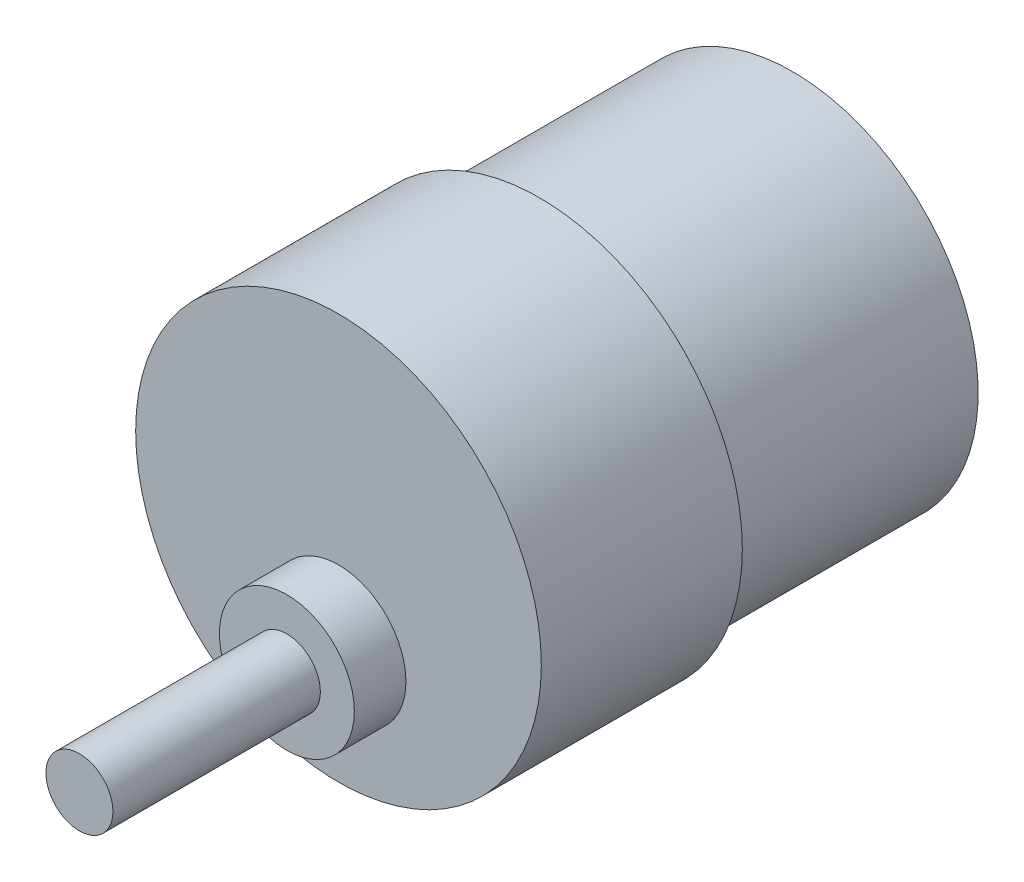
ISO-10303-21;
HEADER;
FILE_DESCRIPTION(('STEP AP214'),'2;1');
FILE_NAME('part.step','',(''),(''),'','','');
FILE_SCHEMA(('AUTOMOTIVE_DESIGN { 1 0 10303 214 1 1 1 1 }'));
ENDSEC;
DATA;
#1=APPLICATION_CONTEXT('core data for automotive mechanical design processes');
#2=APPLICATION_PROTOCOL_DEFINITION('international standard','automotive_design',2000,#1);
#3=PRODUCT_CONTEXT('',#1,'mechanical');
#4=PRODUCT('Part','Part','',(#3));
#5=PRODUCT_RELATED_PRODUCT_CATEGORY('part','',(#4));
#6=PRODUCT_DEFINITION_FORMATION('','',#4);
#7=PRODUCT_DEFINITION_CONTEXT('part definition',#1,'design');
#8=PRODUCT_DEFINITION('design','',#6,#7);
#9=PRODUCT_DEFINITION_SHAPE('','',#8);
#10=(LENGTH_UNIT() NAMED_UNIT(*) SI_UNIT(.MILLI.,.METRE.));
#11=(NAMED_UNIT(*) PLANE_ANGLE_UNIT() SI_UNIT($,.RADIAN.));
#12=(NAMED_UNIT(*) SI_UNIT($,.STERADIAN.) SOLID_ANGLE_UNIT());
#13=UNCERTAINTY_MEASURE_WITH_UNIT(LENGTH_MEASURE(1.E-05),#10,'distance_accuracy_value','');
#14=(GEOMETRIC_REPRESENTATION_CONTEXT(3) GLOBAL_UNCERTAINTY_ASSIGNED_CONTEXT((#13)) GLOBAL_UNIT_ASSIGNED_CONTEXT((#10,
#11,#12)) REPRESENTATION_CONTEXT('',''));
#15=CARTESIAN_POINT('',(0.,0.,0.));
#16=DIRECTION('',(0.,0.,1.));
#17=DIRECTION('',(1.,0.,0.));
#18=AXIS2_PLACEMENT_3D('',#15,#16,#17);
#19=CARTESIAN_POINT('',(0.,0.,22.606));
#20=DIRECTION('',(0.,0.,-1.));
#21=DIRECTION('',(-1.,0.,0.));
#22=AXIS2_PLACEMENT_3D('',#19,#20,#21);
#23=CYLINDRICAL_SURFACE('',#22,16.5735);
#24=CARTESIAN_POINT('',(0.,0.,22.606));
#25=DIRECTION('',(0.,0.,1.));
#26=DIRECTION('',(1.,0.,0.));
#27=AXIS2_PLACEMENT_3D('',#24,#25,#26);
#28=CIRCLE('',#27,16.5735);
#29=CARTESIAN_POINT('',(-16.5735,0.,22.606));
#30=VERTEX_POINT('',#29);
#31=EDGE_CURVE('E38',#30,#30,#28,.T.);
#32=CARTESIAN_POINT('',(0.,0.,0.));
#33=DIRECTION('',(0.,0.,1.));
#34=DIRECTION('',(1.,0.,0.));
#35=AXIS2_PLACEMENT_3D('',#32,#33,#34);
#36=CIRCLE('',#35,16.5735);
#37=CARTESIAN_POINT('',(-16.5735,0.,0.));
#38=VERTEX_POINT('',#37);
#39=EDGE_CURVE('E34',#38,#38,#36,.T.);
#40=CARTESIAN_POINT('',(-16.5735,0.,22.606));
#41=CARTESIAN_POINT('',(-16.5735,0.,22.3705208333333));
#42=CARTESIAN_POINT('',(-16.5735,0.,22.1350416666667));
#43=CARTESIAN_POINT('',(-16.5735,0.,21.6640833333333));
#44=CARTESIAN_POINT('',(-16.5735,0.,21.4286041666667));
#45=CARTESIAN_POINT('',(-16.5735,0.,20.9576458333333));
#46=CARTESIAN_POINT('',(-16.5735,0.,20.7221666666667));
#47=CARTESIAN_POINT('',(-16.5735,0.,20.2512083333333));
#48=CARTESIAN_POINT('',(-16.5735,0.,20.0157291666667));
#49=CARTESIAN_POINT('',(-16.5735,0.,19.5447708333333));
#50=CARTESIAN_POINT('',(-16.5735,0.,19.3092916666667));
#51=CARTESIAN_POINT('',(-16.5735,0.,18.8383333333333));
#52=CARTESIAN_POINT('',(-16.5735,0.,18.6028541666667));
#53=CARTESIAN_POINT('',(-16.5735,0.,18.1318958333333));
#54=CARTESIAN_POINT('',(-16.5735,0.,17.8964166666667));
#55=CARTESIAN_POINT('',(-16.5735,0.,17.4254583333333));
#56=CARTESIAN_POINT('',(-16.5735,0.,17.1899791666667));
#57=CARTESIAN_POINT('',(-16.5735,0.,16.7190208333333));
#58=CARTESIAN_POINT('',(-16.5735,0.,16.4835416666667));
#59=CARTESIAN_POINT('',(-16.5735,0.,16.0125833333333));
#60=CARTESIAN_POINT('',(-16.5735,0.,15.7771041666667));
#61=CARTESIAN_POINT('',(-16.5735,0.,15.3061458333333));
#62=CARTESIAN_POINT('',(-16.5735,0.,15.0706666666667));
#63=CARTESIAN_POINT('',(-16.5735,0.,14.5997083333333));
#64=CARTESIAN_POINT('',(-16.5735,0.,14.3642291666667));
#65=CARTESIAN_POINT('',(-16.5735,0.,13.8932708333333));
#66=CARTESIAN_POINT('',(-16.5735,0.,13.6577916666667));
#67=CARTESIAN_POINT('',(-16.5735,0.,13.1868333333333));
#68=CARTESIAN_POINT('',(-16.5735,0.,12.9513541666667));
#69=CARTESIAN_POINT('',(-16.5735,0.,12.4803958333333));
#70=CARTESIAN_POINT('',(-16.5735,0.,12.2449166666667));
#71=CARTESIAN_POINT('',(-16.5735,0.,11.7739583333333));
#72=CARTESIAN_POINT('',(-16.5735,0.,11.5384791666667));
#73=CARTESIAN_POINT('',(-16.5735,0.,11.0675208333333));
#74=CARTESIAN_POINT('',(-16.5735,0.,10.8320416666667));
#75=CARTESIAN_POINT('',(-16.5735,0.,10.3610833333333));
#76=CARTESIAN_POINT('',(-16.5735,0.,10.1256041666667));
#77=CARTESIAN_POINT('',(-16.5735,0.,9.65464583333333));
#78=CARTESIAN_POINT('',(-16.5735,0.,9.41916666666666));
#79=CARTESIAN_POINT('',(-16.5735,0.,8.94820833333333));
#80=CARTESIAN_POINT('',(-16.5735,0.,8.71272916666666));
#81=CARTESIAN_POINT('',(-16.5735,0.,8.24177083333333));
#82=CARTESIAN_POINT('',(-16.5735,0.,8.00629166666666));
#83=CARTESIAN_POINT('',(-16.5735,0.,7.53533333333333));
#84=CARTESIAN_POINT('',(-16.5735,0.,7.29985416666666));
#85=CARTESIAN_POINT('',(-16.5735,0.,6.82889583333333));
#86=CARTESIAN_POINT('',(-16.5735,0.,6.59341666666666));
#87=CARTESIAN_POINT('',(-16.5735,0.,6.12245833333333));
#88=CARTESIAN_POINT('',(-16.5735,0.,5.88697916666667));
#89=CARTESIAN_POINT('',(-16.5735,0.,5.41602083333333));
#90=CARTESIAN_POINT('',(-16.5735,0.,5.18054166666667));
#91=CARTESIAN_POINT('',(-16.5735,0.,4.70958333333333));
#92=CARTESIAN_POINT('',(-16.5735,0.,4.47410416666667));
#93=CARTESIAN_POINT('',(-16.5735,0.,4.00314583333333));
#94=CARTESIAN_POINT('',(-16.5735,0.,3.76766666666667));
#95=CARTESIAN_POINT('',(-16.5735,0.,3.29670833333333));
#96=CARTESIAN_POINT('',(-16.5735,0.,3.06122916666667));
#97=CARTESIAN_POINT('',(-16.5735,0.,2.59027083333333));
#98=CARTESIAN_POINT('',(-16.5735,0.,2.35479166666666));
#99=CARTESIAN_POINT('',(-16.5735,0.,1.88383333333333));
#100=CARTESIAN_POINT('',(-16.5735,0.,1.64835416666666));
#101=CARTESIAN_POINT('',(-16.5735,0.,1.17739583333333));
#102=CARTESIAN_POINT('',(-16.5735,0.,0.941916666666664));
#103=CARTESIAN_POINT('',(-16.5735,0.,0.47095833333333));
#104=CARTESIAN_POINT('',(-16.5735,0.,0.235479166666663));
#105=CARTESIAN_POINT('',(-16.5735,0.,0.));
#106=B_SPLINE_CURVE_WITH_KNOTS('',3,(#40,#41,#42,#43,#44,#45,#46,#47,#48,#49,#50,#51,#52,#53,
#54,#55,#56,#57,#58,#59,#60,#61,#62,#63,#64,#65,#66,#67,#68,#69,#70,#71,#72,#73,#74,#75,#76,#77,
#78,#79,#80,#81,#82,#83,#84,#85,#86,#87,#88,#89,#90,#91,#92,#93,#94,#95,#96,#97,#98,#99,#100,
#101,#102,#103,#104,#105),.UNSPECIFIED.,.F.,.F.,(4,2,2,2,2,2,2,2,2,2,2,2,2,2,2,2,2,2,2,2,2,2,2,
2,2,2,2,2,2,2,2,2,4),(0.,0.7064375,1.412875,2.1193125,2.82575,3.5321875,4.238625,4.9450625,
5.6515,6.3579375,7.064375,7.7708125,8.47725,9.1836875,9.890125,10.5965625,11.303,12.0094375,
12.715875,13.4223125,14.12875,14.8351875,15.541625,16.2480625,16.9545,17.6609375,18.367375,
19.0738125,19.78025,20.4866875,21.193125,21.8995625,22.606),.UNSPECIFIED.);
#107=EDGE_CURVE('BSEAM31',#30,#38,#106,.T.);
#108=ORIENTED_EDGE('',*,*,#31,.F.);
#109=ORIENTED_EDGE('',*,*,#39,.T.);
#110=ORIENTED_EDGE('',*,*,#107,.T.);
#111=ORIENTED_EDGE('',*,*,#107,.F.);
#112=EDGE_LOOP('',(#108,#110,#109,#111));
#113=FACE_BOUND('',#112,.T.);
#114=ADVANCED_FACE('F31',(#113),#23,.T.);
#115=CARTESIAN_POINT('',(0.,0.,0.));
#116=DIRECTION('',(0.,0.,1.));
#117=DIRECTION('',(1.,0.,0.));
#118=AXIS2_PLACEMENT_3D('',#115,#116,#117);
#119=PLANE('',#118);
#120=ORIENTED_EDGE('',*,*,#39,.F.);
#121=EDGE_LOOP('',(#120));
#122=FACE_BOUND('',#121,.T.);
#123=ADVANCED_FACE('F78',(#122),#119,.F.);
#124=CARTESIAN_POINT('',(0.,0.,40.5638));
#125=DIRECTION('',(0.,0.,-1.));
#126=DIRECTION('',(-1.,0.,0.));
#127=AXIS2_PLACEMENT_3D('',#124,#125,#126);
#128=CYLINDRICAL_SURFACE('',#127,18.11655);
#129=CARTESIAN_POINT('',(0.,0.,40.5638));
#130=DIRECTION('',(0.,0.,1.));
#131=DIRECTION('',(1.,0.,0.));
#132=AXIS2_PLACEMENT_3D('',#129,#130,#131);
#133=CIRCLE('',#132,18.11655);
#134=CARTESIAN_POINT('',(18.11655,0.,40.5638));
#135=VERTEX_POINT('',#134);
#136=EDGE_CURVE('E53',#135,#135,#133,.T.);
#137=ORIENTED_EDGE('',*,*,#136,.F.);
#138=EDGE_LOOP('',(#137));
#139=FACE_BOUND('',#138,.T.);
#140=CARTESIAN_POINT('',(0.,0.,22.606));
#141=DIRECTION('',(0.,0.,1.));
#142=DIRECTION('',(1.,0.,0.));
#143=AXIS2_PLACEMENT_3D('',#140,#141,#142);
#144=CIRCLE('',#143,18.11655);
#145=CARTESIAN_POINT('',(18.11655,0.,22.606));
#146=VERTEX_POINT('',#145);
#147=EDGE_CURVE('E49',#146,#146,#144,.T.);
#148=ORIENTED_EDGE('',*,*,#147,.T.);
#149=EDGE_LOOP('',(#148));
#150=FACE_BOUND('',#149,.T.);
#151=ADVANCED_FACE('F59',(#139,#150),#128,.T.);
#152=CARTESIAN_POINT('',(0.,0.,40.5638));
#153=DIRECTION('',(0.,0.,1.));
#154=DIRECTION('',(1.,0.,0.));
#155=AXIS2_PLACEMENT_3D('',#152,#153,#154);
#156=PLANE('',#155);
#157=CARTESIAN_POINT('',(0.,-7.3279,40.5638));
#158=DIRECTION('',(0.,0.,1.));
#159=DIRECTION('',(1.,0.,0.));
#160=AXIS2_PLACEMENT_3D('',#157,#158,#159);
#161=CIRCLE('',#160,6.02615);
#162=CARTESIAN_POINT('',(6.02615,-7.3279,40.5638));
#163=VERTEX_POINT('',#162);
#164=EDGE_CURVE('E50',#163,#163,#161,.T.);
#165=ORIENTED_EDGE('',*,*,#164,.F.);
#166=EDGE_LOOP('',(#165));
#167=FACE_BOUND('',#166,.T.);
#168=ORIENTED_EDGE('',*,*,#136,.T.);
#169=EDGE_LOOP('',(#168));
#170=FACE_BOUND('',#169,.T.);
#171=ADVANCED_FACE('F64',(#167,#170),#156,.T.);
#172=CARTESIAN_POINT('',(0.,0.,22.606));
#173=DIRECTION('',(0.,0.,1.));
#174=DIRECTION('',(1.,0.,0.));
#175=AXIS2_PLACEMENT_3D('',#172,#173,#174);
#176=PLANE('',#175);
#177=ORIENTED_EDGE('',*,*,#31,.T.);
#178=EDGE_LOOP('',(#177));
#179=FACE_BOUND('',#178,.T.);
#180=ORIENTED_EDGE('',*,*,#147,.F.);
#181=EDGE_LOOP('',(#180));
#182=FACE_BOUND('',#181,.T.);
#183=ADVANCED_FACE('F61',(#179,#182),#176,.F.);
#184=CARTESIAN_POINT('',(0.,-7.3279,45.1739));
#185=DIRECTION('',(0.,0.,-1.));
#186=DIRECTION('',(-1.,0.,0.));
#187=AXIS2_PLACEMENT_3D('',#184,#185,#186);
#188=CYLINDRICAL_SURFACE('',#187,6.02615);
#189=CARTESIAN_POINT('',(0.,-7.3279,45.1739));
#190=DIRECTION('',(0.,0.,1.));
#191=DIRECTION('',(1.,0.,0.));
#192=AXIS2_PLACEMENT_3D('',#189,#190,#191);
#193=CIRCLE('',#192,6.02615);
#194=CARTESIAN_POINT('',(6.02615,-7.3279,45.1739));
#195=VERTEX_POINT('',#194);
#196=EDGE_CURVE('E46',#195,#195,#193,.T.);
#197=ORIENTED_EDGE('',*,*,#196,.F.);
#198=EDGE_LOOP('',(#197));
#199=FACE_BOUND('',#198,.T.);
#200=ORIENTED_EDGE('',*,*,#164,.T.);
#201=EDGE_LOOP('',(#200));
#202=FACE_BOUND('',#201,.T.);
#203=ADVANCED_FACE('F63',(#199,#202),#188,.T.);
#204=CARTESIAN_POINT('',(0.,-7.3279,45.1739));
#205=DIRECTION('',(0.,0.,1.));
#206=DIRECTION('',(1.,0.,0.));
#207=AXIS2_PLACEMENT_3D('',#204,#205,#206);
#208=PLANE('',#207);
#209=CARTESIAN_POINT('',(0.,-7.3279,45.1739));
#210=DIRECTION('',(0.,0.,1.));
#211=DIRECTION('',(1.,0.,0.));
#212=AXIS2_PLACEMENT_3D('',#209,#210,#211);
#213=CIRCLE('',#212,2.99085);
#214=CARTESIAN_POINT('',(2.99085,-7.3279,45.1739));
#215=VERTEX_POINT('',#214);
#216=EDGE_CURVE('E10',#215,#215,#213,.T.);
#217=ORIENTED_EDGE('',*,*,#216,.F.);
#218=EDGE_LOOP('',(#217));
#219=FACE_BOUND('',#218,.T.);
#220=ORIENTED_EDGE('',*,*,#196,.T.);
#221=EDGE_LOOP('',(#220));
#222=FACE_BOUND('',#221,.T.);
#223=ADVANCED_FACE('F71',(#219,#222),#208,.T.);
#224=CARTESIAN_POINT('',(0.,-7.3279,63.7032));
#225=DIRECTION('',(0.,0.,-1.));
#226=DIRECTION('',(-1.,0.,0.));
#227=AXIS2_PLACEMENT_3D('',#224,#225,#226);
#228=CYLINDRICAL_SURFACE('',#227,2.99085);
#229=CARTESIAN_POINT('',(0.,-7.3279,63.7032));
#230=DIRECTION('',(0.,0.,1.));
#231=DIRECTION('',(1.,0.,0.));
#232=AXIS2_PLACEMENT_3D('',#229,#230,#231);
#233=CIRCLE('',#232,2.99085);
#234=CARTESIAN_POINT('',(2.99085,-7.3279,63.7032));
#235=VERTEX_POINT('',#234);
#236=EDGE_CURVE('E45',#235,#235,#233,.T.);
#237=ORIENTED_EDGE('',*,*,#236,.F.);
#238=EDGE_LOOP('',(#237));
#239=FACE_BOUND('',#238,.T.);
#240=ORIENTED_EDGE('',*,*,#216,.T.);
#241=EDGE_LOOP('',(#240));
#242=FACE_BOUND('',#241,.T.);
#243=ADVANCED_FACE('F117',(#239,#242),#228,.T.);
#244=CARTESIAN_POINT('',(0.,-7.3279,63.7032));
#245=DIRECTION('',(0.,0.,1.));
#246=DIRECTION('',(1.,0.,0.));
#247=AXIS2_PLACEMENT_3D('',#244,#245,#246);
#248=PLANE('',#247);
#249=ORIENTED_EDGE('',*,*,#236,.T.);
#250=EDGE_LOOP('',(#249));
#251=FACE_BOUND('',#250,.T.);
#252=ADVANCED_FACE('F127',(#251),#248,.T.);
#253=CLOSED_SHELL('',(#114,#123,#151,#171,#183,#203,#223,#243,#252));
#254=MANIFOLD_SOLID_BREP('B2',#253);
#255=ADVANCED_BREP_SHAPE_REPRESENTATION('',(#18,#254),#14);
#256=SHAPE_DEFINITION_REPRESENTATION(#9,#255);
ENDSEC;
END-ISO-10303-21;
